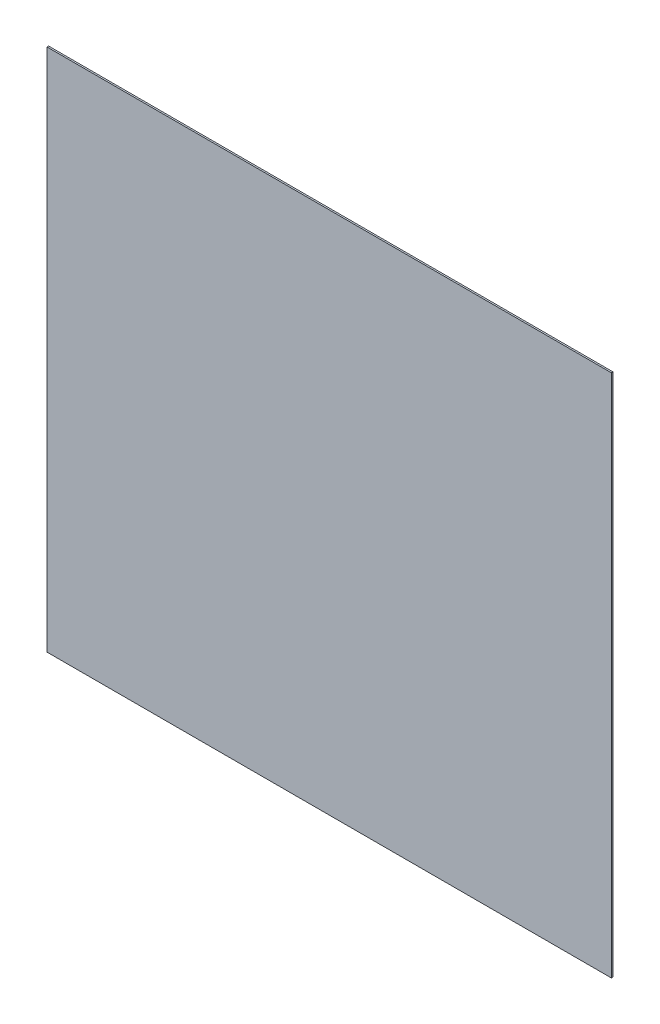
from build123d import *

# Parameters (mm, degrees)
EW_SKETCH_W    = 700
EW_SKETCH_H    = 650
EXTRUDE1_DEPTH = 2


with BuildPart() as part:
    # EW_SKETCH → Extrude1 (new body)
    with BuildSketch(Plane.XY):
        with Locations((350, 325)):
            Rectangle(EW_SKETCH_W, EW_SKETCH_H)
    extrude(amount=EXTRUDE1_DEPTH)


solid = part.part
